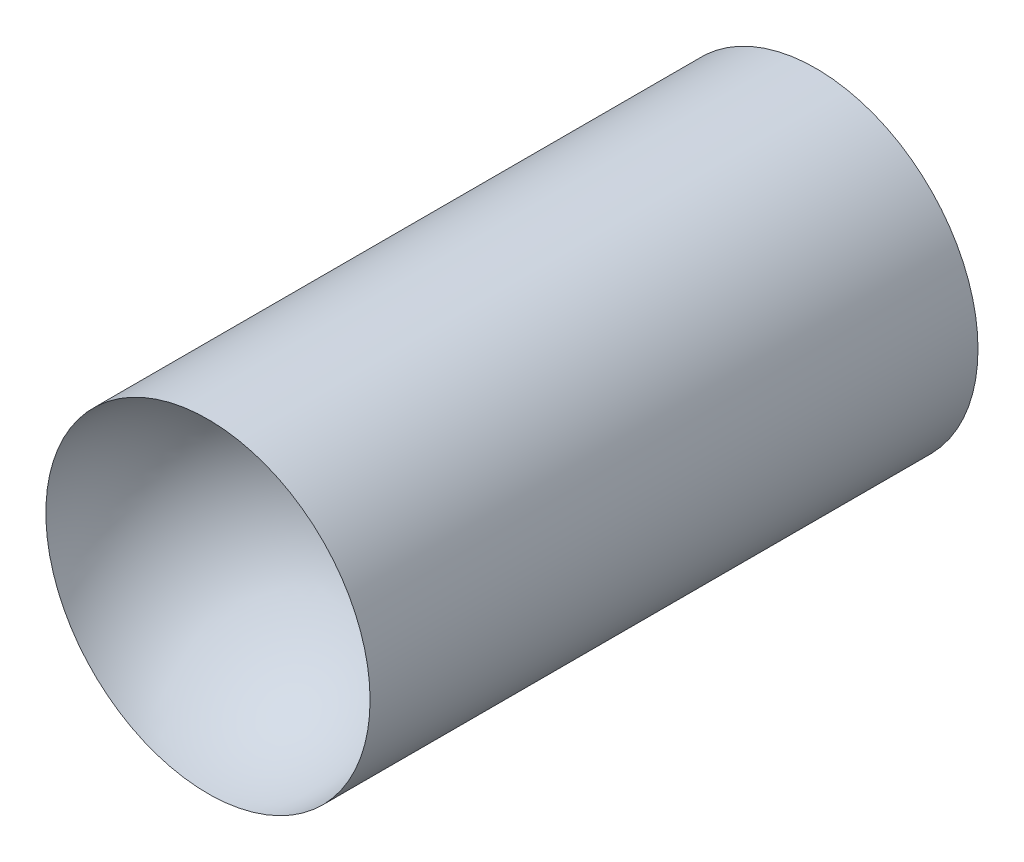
from build123d import *

# Parameters (mm, degrees)
ESQUISSE1_R      = 4
EXTRUSION1_DEPTH = 15


with BuildPart() as part:
    # Esquisse1 → Extrusion1 (new body)
    with BuildSketch(Plane.XY):
        Circle(ESQUISSE1_R)
    extrude(amount=EXTRUSION1_DEPTH)

    # Esquisse3 → Enl_vement de mati_re-R_volution1 (revolve, cut)
    with BuildSketch(Plane(origin=(0, 0, 0), x_dir=(1, 0, 0), z_dir=(0, 1, 0))):
        with BuildLine():
            Line((0, -15), (4, -15))
            ThreePointArc((4, -15), (2.828427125, -12.171572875), (0, -11))
            Line((0, -11), (0, -15))
        make_face()
    revolve(axis=Axis((0, 0, 17.458635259), (0, 0, -1)), mode=Mode.SUBTRACT)


solid = part.part
